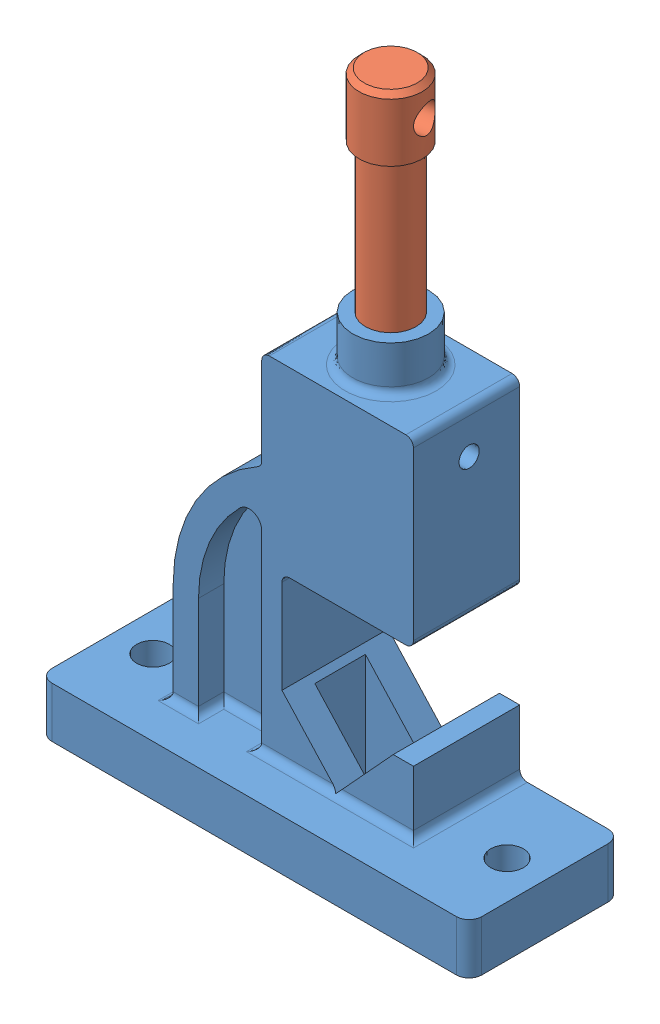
SolidWorks assembly Smart mate Assembly.SLDASM, configuration Default (file format 11000). Lengths in mm.
Overall size (170 258.7 60).
2 component instances, 2 part files, 1 mates.
Components (placement in the parent):
- base-1: base.SLDPRT [Default] at (-64.0815 -78.7806 27.8911) size (170 175 60)
- screw-1: screw.SLDPRT [Default] at (-49.0815 35.4563 18.8911) x (0.204231 0 0.978923) z (-0.978923 0 0.204231) size (25 144.46 25)
Mates (geometry in assembly coordinates):
- Concentric3: concentric: cylinder of assembly; cylinder of assembly; cylinder of base-1 through (-49.0815 -78.7806 18.8911) axis (0 1 0) radius 10; cylinder of screw-1 through (-49.0815 35.4563 18.8911) axis (0 -1 0) radius 10
